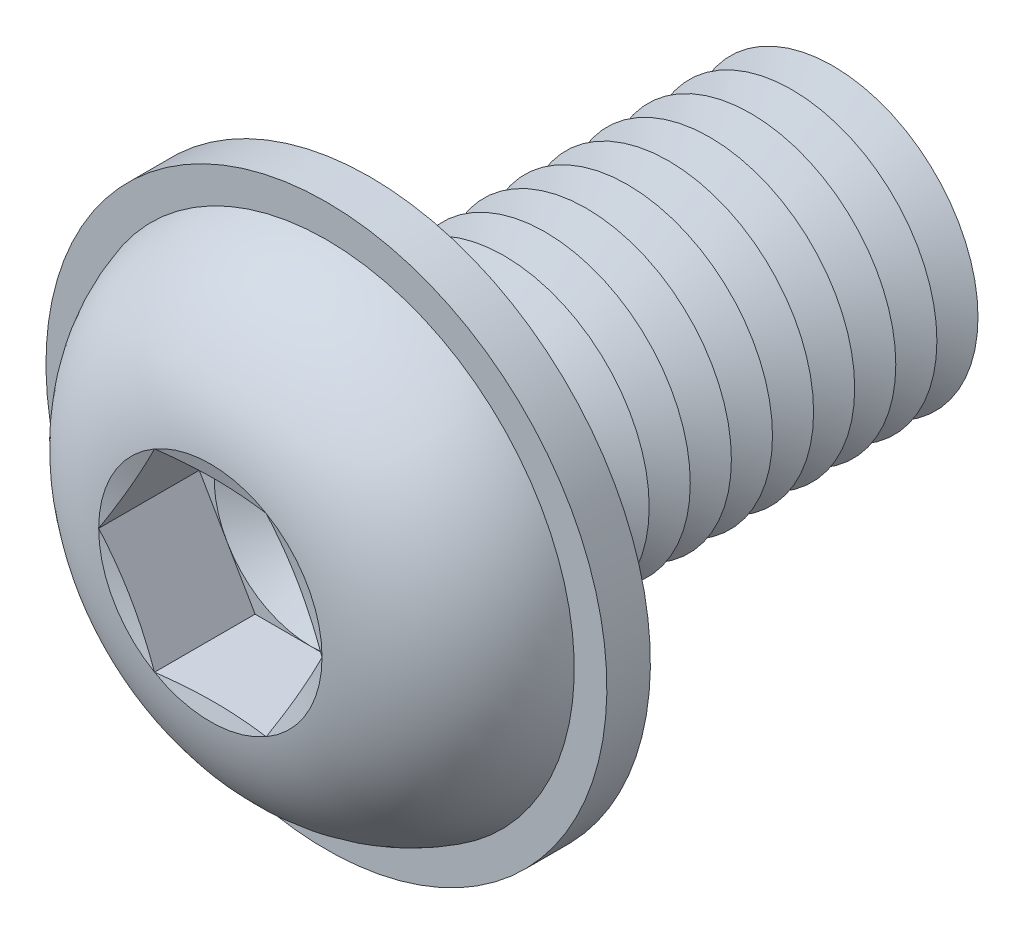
ISO-10303-21;
HEADER;
FILE_DESCRIPTION(('STEP AP214'),'2;1');
FILE_NAME('part.step','',(''),(''),'','','');
FILE_SCHEMA(('AUTOMOTIVE_DESIGN { 1 0 10303 214 1 1 1 1 }'));
ENDSEC;
DATA;
#1=APPLICATION_CONTEXT('core data for automotive mechanical design processes');
#2=APPLICATION_PROTOCOL_DEFINITION('international standard','automotive_design',2000,#1);
#3=PRODUCT_CONTEXT('',#1,'mechanical');
#4=PRODUCT('Part','Part','',(#3));
#5=PRODUCT_RELATED_PRODUCT_CATEGORY('part','',(#4));
#6=PRODUCT_DEFINITION_FORMATION('','',#4);
#7=PRODUCT_DEFINITION_CONTEXT('part definition',#1,'design');
#8=PRODUCT_DEFINITION('design','',#6,#7);
#9=PRODUCT_DEFINITION_SHAPE('','',#8);
#10=(LENGTH_UNIT() NAMED_UNIT(*) SI_UNIT(.MILLI.,.METRE.));
#11=(NAMED_UNIT(*) PLANE_ANGLE_UNIT() SI_UNIT($,.RADIAN.));
#12=(NAMED_UNIT(*) SI_UNIT($,.STERADIAN.) SOLID_ANGLE_UNIT());
#13=UNCERTAINTY_MEASURE_WITH_UNIT(LENGTH_MEASURE(1.E-05),#10,'distance_accuracy_value','');
#14=(GEOMETRIC_REPRESENTATION_CONTEXT(3) GLOBAL_UNCERTAINTY_ASSIGNED_CONTEXT((#13)) GLOBAL_UNIT_ASSIGNED_CONTEXT((#10,
#11,#12)) REPRESENTATION_CONTEXT('',''));
#15=CARTESIAN_POINT('',(0.,0.,0.));
#16=DIRECTION('',(0.,0.,1.));
#17=DIRECTION('',(1.,0.,0.));
#18=AXIS2_PLACEMENT_3D('',#15,#16,#17);
#19=CARTESIAN_POINT('',(0.,0.,-14.05));
#20=DIRECTION('',(0.,0.,1.));
#21=DIRECTION('',(0.,-1.,0.));
#22=AXIS2_PLACEMENT_3D('',#19,#20,#21);
#23=CONICAL_SURFACE('',#22,5.99999999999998,1.0471975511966);
#24=CARTESIAN_POINT('',(0.,0.,-14.9));
#25=DIRECTION('',(0.,0.,1.));
#26=DIRECTION('',(0.,-1.,0.));
#27=AXIS2_PLACEMENT_3D('',#24,#25,#26);
#28=CIRCLE('',#27,4.52775681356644);
#29=CARTESIAN_POINT('',(0.,-4.52775681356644,-14.9));
#30=VERTEX_POINT('',#29);
#31=EDGE_CURVE('E296',#30,#30,#28,.T.);
#32=ORIENTED_EDGE('',*,*,#31,.T.);
#33=EDGE_LOOP('',(#32));
#34=FACE_BOUND('',#33,.T.);
#35=CARTESIAN_POINT('',(0.,0.,-14.05));
#36=DIRECTION('',(0.,0.,1.));
#37=DIRECTION('',(0.,-1.,0.));
#38=AXIS2_PLACEMENT_3D('',#35,#36,#37);
#39=CIRCLE('',#38,5.99999999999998);
#40=CARTESIAN_POINT('',(0.,-5.99999999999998,-14.05));
#41=VERTEX_POINT('',#40);
#42=EDGE_CURVE('E292',#41,#41,#39,.T.);
#43=ORIENTED_EDGE('',*,*,#42,.F.);
#44=EDGE_LOOP('',(#43));
#45=FACE_BOUND('',#44,.T.);
#46=ADVANCED_FACE('F38',(#34,#45),#23,.T.);
#47=CARTESIAN_POINT('',(0.,0.,-14.9));
#48=DIRECTION('',(0.,0.,-1.));
#49=DIRECTION('',(0.,1.,0.));
#50=AXIS2_PLACEMENT_3D('',#47,#48,#49);
#51=CONICAL_SURFACE('',#50,4.52775681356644,1.04719755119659);
#52=CARTESIAN_POINT('',(0.,0.,-15.75));
#53=DIRECTION('',(0.,0.,1.));
#54=DIRECTION('',(0.,-1.,0.));
#55=AXIS2_PLACEMENT_3D('',#52,#53,#54);
#56=CIRCLE('',#55,5.99999999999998);
#57=CARTESIAN_POINT('',(0.,-5.99999999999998,-15.75));
#58=VERTEX_POINT('',#57);
#59=EDGE_CURVE('E300',#58,#58,#56,.T.);
#60=ORIENTED_EDGE('',*,*,#59,.T.);
#61=EDGE_LOOP('',(#60));
#62=FACE_BOUND('',#61,.T.);
#63=ORIENTED_EDGE('',*,*,#31,.F.);
#64=EDGE_LOOP('',(#63));
#65=FACE_BOUND('',#64,.T.);
#66=ADVANCED_FACE('F421',(#62,#65),#51,.T.);
#67=CARTESIAN_POINT('',(0.,5.99999999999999,-20.));
#68=DIRECTION('',(0.,0.,-1.));
#69=DIRECTION('',(0.,1.,0.));
#70=AXIS2_PLACEMENT_3D('',#67,#68,#69);
#71=PLANE('',#70);
#72=CARTESIAN_POINT('',(0.,0.,-20.));
#73=DIRECTION('',(0.,0.,1.));
#74=DIRECTION('',(0.,-1.,0.));
#75=AXIS2_PLACEMENT_3D('',#72,#73,#74);
#76=CIRCLE('',#75,4.52775681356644);
#77=CARTESIAN_POINT('',(0.,-4.52775681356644,-20.));
#78=VERTEX_POINT('',#77);
#79=EDGE_CURVE('E320',#78,#78,#76,.T.);
#80=ORIENTED_EDGE('',*,*,#79,.F.);
#81=EDGE_LOOP('',(#80));
#82=FACE_BOUND('',#81,.T.);
#83=ADVANCED_FACE('F427',(#82),#71,.T.);
#84=CARTESIAN_POINT('',(0.,0.,-19.15));
#85=DIRECTION('',(0.,0.,1.));
#86=DIRECTION('',(0.,-1.,0.));
#87=AXIS2_PLACEMENT_3D('',#84,#85,#86);
#88=CONICAL_SURFACE('',#87,5.99999999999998,1.0471975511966);
#89=ORIENTED_EDGE('',*,*,#79,.T.);
#90=EDGE_LOOP('',(#89));
#91=FACE_BOUND('',#90,.T.);
#92=CARTESIAN_POINT('',(0.,0.,-19.15));
#93=DIRECTION('',(0.,0.,1.));
#94=DIRECTION('',(0.,-1.,0.));
#95=AXIS2_PLACEMENT_3D('',#92,#93,#94);
#96=CIRCLE('',#95,5.99999999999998);
#97=CARTESIAN_POINT('',(0.,-5.99999999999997,-19.15));
#98=VERTEX_POINT('',#97);
#99=EDGE_CURVE('E316',#98,#98,#96,.T.);
#100=ORIENTED_EDGE('',*,*,#99,.F.);
#101=EDGE_LOOP('',(#100));
#102=FACE_BOUND('',#101,.T.);
#103=ADVANCED_FACE('F446',(#91,#102),#88,.T.);
#104=CARTESIAN_POINT('',(0.,0.,-18.3));
#105=DIRECTION('',(0.,0.,-1.));
#106=DIRECTION('',(0.,1.,0.));
#107=AXIS2_PLACEMENT_3D('',#104,#105,#106);
#108=CONICAL_SURFACE('',#107,4.52775681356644,1.04719755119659);
#109=ORIENTED_EDGE('',*,*,#99,.T.);
#110=EDGE_LOOP('',(#109));
#111=FACE_BOUND('',#110,.T.);
#112=CARTESIAN_POINT('',(0.,0.,-18.3));
#113=DIRECTION('',(0.,0.,1.));
#114=DIRECTION('',(0.,-1.,0.));
#115=AXIS2_PLACEMENT_3D('',#112,#113,#114);
#116=CIRCLE('',#115,4.52775681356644);
#117=CARTESIAN_POINT('',(0.,-4.52775681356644,-18.3));
#118=VERTEX_POINT('',#117);
#119=EDGE_CURVE('E312',#118,#118,#116,.T.);
#120=ORIENTED_EDGE('',*,*,#119,.F.);
#121=EDGE_LOOP('',(#120));
#122=FACE_BOUND('',#121,.T.);
#123=ADVANCED_FACE('F443',(#111,#122),#108,.T.);
#124=CARTESIAN_POINT('',(0.,0.,-17.45));
#125=DIRECTION('',(0.,0.,1.));
#126=DIRECTION('',(0.,-1.,0.));
#127=AXIS2_PLACEMENT_3D('',#124,#125,#126);
#128=CONICAL_SURFACE('',#127,5.99999999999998,1.0471975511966);
#129=ORIENTED_EDGE('',*,*,#119,.T.);
#130=EDGE_LOOP('',(#129));
#131=FACE_BOUND('',#130,.T.);
#132=CARTESIAN_POINT('',(0.,0.,-17.45));
#133=DIRECTION('',(0.,0.,1.));
#134=DIRECTION('',(0.,-1.,0.));
#135=AXIS2_PLACEMENT_3D('',#132,#133,#134);
#136=CIRCLE('',#135,5.99999999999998);
#137=CARTESIAN_POINT('',(0.,-5.99999999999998,-17.45));
#138=VERTEX_POINT('',#137);
#139=EDGE_CURVE('E308',#138,#138,#136,.T.);
#140=ORIENTED_EDGE('',*,*,#139,.F.);
#141=EDGE_LOOP('',(#140));
#142=FACE_BOUND('',#141,.T.);
#143=ADVANCED_FACE('F437',(#131,#142),#128,.T.);
#144=CARTESIAN_POINT('',(0.,0.,-16.6));
#145=DIRECTION('',(0.,0.,-1.));
#146=DIRECTION('',(0.,1.,0.));
#147=AXIS2_PLACEMENT_3D('',#144,#145,#146);
#148=CONICAL_SURFACE('',#147,4.52775681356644,1.04719755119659);
#149=ORIENTED_EDGE('',*,*,#139,.T.);
#150=EDGE_LOOP('',(#149));
#151=FACE_BOUND('',#150,.T.);
#152=CARTESIAN_POINT('',(0.,0.,-16.6));
#153=DIRECTION('',(0.,0.,1.));
#154=DIRECTION('',(0.,-1.,0.));
#155=AXIS2_PLACEMENT_3D('',#152,#153,#154);
#156=CIRCLE('',#155,4.52775681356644);
#157=CARTESIAN_POINT('',(0.,-4.52775681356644,-16.6));
#158=VERTEX_POINT('',#157);
#159=EDGE_CURVE('E304',#158,#158,#156,.T.);
#160=ORIENTED_EDGE('',*,*,#159,.F.);
#161=EDGE_LOOP('',(#160));
#162=FACE_BOUND('',#161,.T.);
#163=ADVANCED_FACE('F433',(#151,#162),#148,.T.);
#164=CARTESIAN_POINT('',(0.,0.,-15.75));
#165=DIRECTION('',(0.,0.,1.));
#166=DIRECTION('',(0.,-1.,0.));
#167=AXIS2_PLACEMENT_3D('',#164,#165,#166);
#168=CONICAL_SURFACE('',#167,5.99999999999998,1.0471975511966);
#169=ORIENTED_EDGE('',*,*,#159,.T.);
#170=EDGE_LOOP('',(#169));
#171=FACE_BOUND('',#170,.T.);
#172=ORIENTED_EDGE('',*,*,#59,.F.);
#173=EDGE_LOOP('',(#172));
#174=FACE_BOUND('',#173,.T.);
#175=ADVANCED_FACE('F436',(#171,#174),#168,.T.);
#176=CARTESIAN_POINT('',(0.,0.,-12.35));
#177=DIRECTION('',(0.,0.,1.));
#178=DIRECTION('',(0.,-1.,0.));
#179=AXIS2_PLACEMENT_3D('',#176,#177,#178);
#180=CONICAL_SURFACE('',#179,5.99999999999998,1.0471975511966);
#181=CARTESIAN_POINT('',(0.,0.,-13.2));
#182=DIRECTION('',(0.,0.,1.));
#183=DIRECTION('',(0.,-1.,0.));
#184=AXIS2_PLACEMENT_3D('',#181,#182,#183);
#185=CIRCLE('',#184,4.52775681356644);
#186=CARTESIAN_POINT('',(0.,-4.52775681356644,-13.2));
#187=VERTEX_POINT('',#186);
#188=EDGE_CURVE('E288',#187,#187,#185,.T.);
#189=ORIENTED_EDGE('',*,*,#188,.T.);
#190=EDGE_LOOP('',(#189));
#191=FACE_BOUND('',#190,.T.);
#192=CARTESIAN_POINT('',(0.,0.,-12.35));
#193=DIRECTION('',(0.,0.,1.));
#194=DIRECTION('',(0.,-1.,0.));
#195=AXIS2_PLACEMENT_3D('',#192,#193,#194);
#196=CIRCLE('',#195,5.99999999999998);
#197=CARTESIAN_POINT('',(0.,-5.99999999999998,-12.35));
#198=VERTEX_POINT('',#197);
#199=EDGE_CURVE('E284',#198,#198,#196,.T.);
#200=ORIENTED_EDGE('',*,*,#199,.F.);
#201=EDGE_LOOP('',(#200));
#202=FACE_BOUND('',#201,.T.);
#203=ADVANCED_FACE('F441',(#191,#202),#180,.T.);
#204=CARTESIAN_POINT('',(0.,0.,-13.2));
#205=DIRECTION('',(0.,0.,-1.));
#206=DIRECTION('',(0.,1.,0.));
#207=AXIS2_PLACEMENT_3D('',#204,#205,#206);
#208=CONICAL_SURFACE('',#207,4.52775681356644,1.04719755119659);
#209=ORIENTED_EDGE('',*,*,#42,.T.);
#210=EDGE_LOOP('',(#209));
#211=FACE_BOUND('',#210,.T.);
#212=ORIENTED_EDGE('',*,*,#188,.F.);
#213=EDGE_LOOP('',(#212));
#214=FACE_BOUND('',#213,.T.);
#215=ADVANCED_FACE('F492',(#211,#214),#208,.T.);
#216=CARTESIAN_POINT('',(0.,0.,-10.65));
#217=DIRECTION('',(0.,0.,1.));
#218=DIRECTION('',(0.,-1.,0.));
#219=AXIS2_PLACEMENT_3D('',#216,#217,#218);
#220=CONICAL_SURFACE('',#219,5.99999999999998,1.0471975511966);
#221=CARTESIAN_POINT('',(0.,0.,-11.5));
#222=DIRECTION('',(0.,0.,1.));
#223=DIRECTION('',(0.,-1.,0.));
#224=AXIS2_PLACEMENT_3D('',#221,#222,#223);
#225=CIRCLE('',#224,4.52775681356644);
#226=CARTESIAN_POINT('',(0.,-4.52775681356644,-11.5));
#227=VERTEX_POINT('',#226);
#228=EDGE_CURVE('E281',#227,#227,#225,.T.);
#229=ORIENTED_EDGE('',*,*,#228,.T.);
#230=EDGE_LOOP('',(#229));
#231=FACE_BOUND('',#230,.T.);
#232=CARTESIAN_POINT('',(0.,0.,-10.65));
#233=DIRECTION('',(0.,0.,1.));
#234=DIRECTION('',(0.,-1.,0.));
#235=AXIS2_PLACEMENT_3D('',#232,#233,#234);
#236=CIRCLE('',#235,5.99999999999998);
#237=CARTESIAN_POINT('',(0.,-5.99999999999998,-10.65));
#238=VERTEX_POINT('',#237);
#239=EDGE_CURVE('E277',#238,#238,#236,.T.);
#240=ORIENTED_EDGE('',*,*,#239,.F.);
#241=EDGE_LOOP('',(#240));
#242=FACE_BOUND('',#241,.T.);
#243=ADVANCED_FACE('F498',(#231,#242),#220,.T.);
#244=CARTESIAN_POINT('',(0.,0.,-11.5));
#245=DIRECTION('',(0.,0.,-1.));
#246=DIRECTION('',(0.,1.,0.));
#247=AXIS2_PLACEMENT_3D('',#244,#245,#246);
#248=CONICAL_SURFACE('',#247,4.52775681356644,1.04719755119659);
#249=ORIENTED_EDGE('',*,*,#199,.T.);
#250=EDGE_LOOP('',(#249));
#251=FACE_BOUND('',#250,.T.);
#252=ORIENTED_EDGE('',*,*,#228,.F.);
#253=EDGE_LOOP('',(#252));
#254=FACE_BOUND('',#253,.T.);
#255=ADVANCED_FACE('F505',(#251,#254),#248,.T.);
#256=CARTESIAN_POINT('',(0.,0.,-8.95000000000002));
#257=DIRECTION('',(0.,0.,1.));
#258=DIRECTION('',(0.,-1.,0.));
#259=AXIS2_PLACEMENT_3D('',#256,#257,#258);
#260=CONICAL_SURFACE('',#259,5.99999999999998,1.0471975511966);
#261=CARTESIAN_POINT('',(0.,0.,-9.8));
#262=DIRECTION('',(0.,0.,1.));
#263=DIRECTION('',(0.,-1.,0.));
#264=AXIS2_PLACEMENT_3D('',#261,#262,#263);
#265=CIRCLE('',#264,4.52775681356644);
#266=CARTESIAN_POINT('',(0.,-4.52775681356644,-9.80000000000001));
#267=VERTEX_POINT('',#266);
#268=EDGE_CURVE('E273',#267,#267,#265,.T.);
#269=ORIENTED_EDGE('',*,*,#268,.T.);
#270=EDGE_LOOP('',(#269));
#271=FACE_BOUND('',#270,.T.);
#272=CARTESIAN_POINT('',(0.,0.,-8.95000000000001));
#273=DIRECTION('',(0.,0.,1.));
#274=DIRECTION('',(0.,-1.,0.));
#275=AXIS2_PLACEMENT_3D('',#272,#273,#274);
#276=CIRCLE('',#275,5.99999999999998);
#277=CARTESIAN_POINT('',(0.,-5.99999999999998,-8.95000000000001));
#278=VERTEX_POINT('',#277);
#279=EDGE_CURVE('E269',#278,#278,#276,.T.);
#280=ORIENTED_EDGE('',*,*,#279,.F.);
#281=EDGE_LOOP('',(#280));
#282=FACE_BOUND('',#281,.T.);
#283=ADVANCED_FACE('F512',(#271,#282),#260,.T.);
#284=CARTESIAN_POINT('',(0.,0.,-9.8));
#285=DIRECTION('',(0.,0.,-1.));
#286=DIRECTION('',(0.,1.,0.));
#287=AXIS2_PLACEMENT_3D('',#284,#285,#286);
#288=CONICAL_SURFACE('',#287,4.52775681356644,1.04719755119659);
#289=ORIENTED_EDGE('',*,*,#239,.T.);
#290=EDGE_LOOP('',(#289));
#291=FACE_BOUND('',#290,.T.);
#292=ORIENTED_EDGE('',*,*,#268,.F.);
#293=EDGE_LOOP('',(#292));
#294=FACE_BOUND('',#293,.T.);
#295=ADVANCED_FACE('F519',(#291,#294),#288,.T.);
#296=CARTESIAN_POINT('',(0.,0.,-7.25000000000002));
#297=DIRECTION('',(0.,0.,1.));
#298=DIRECTION('',(0.,-1.,0.));
#299=AXIS2_PLACEMENT_3D('',#296,#297,#298);
#300=CONICAL_SURFACE('',#299,5.99999999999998,1.0471975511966);
#301=CARTESIAN_POINT('',(0.,0.,-8.1));
#302=DIRECTION('',(0.,0.,1.));
#303=DIRECTION('',(0.,-1.,0.));
#304=AXIS2_PLACEMENT_3D('',#301,#302,#303);
#305=CIRCLE('',#304,4.52775681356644);
#306=CARTESIAN_POINT('',(0.,-4.52775681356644,-8.10000000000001));
#307=VERTEX_POINT('',#306);
#308=EDGE_CURVE('E265',#307,#307,#305,.T.);
#309=ORIENTED_EDGE('',*,*,#308,.T.);
#310=EDGE_LOOP('',(#309));
#311=FACE_BOUND('',#310,.T.);
#312=CARTESIAN_POINT('',(0.,0.,-7.25000000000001));
#313=DIRECTION('',(0.,0.,1.));
#314=DIRECTION('',(0.,-1.,0.));
#315=AXIS2_PLACEMENT_3D('',#312,#313,#314);
#316=CIRCLE('',#315,5.99999999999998);
#317=CARTESIAN_POINT('',(0.,-5.99999999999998,-7.25000000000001));
#318=VERTEX_POINT('',#317);
#319=EDGE_CURVE('E261',#318,#318,#316,.T.);
#320=ORIENTED_EDGE('',*,*,#319,.F.);
#321=EDGE_LOOP('',(#320));
#322=FACE_BOUND('',#321,.T.);
#323=ADVANCED_FACE('F526',(#311,#322),#300,.T.);
#324=CARTESIAN_POINT('',(0.,0.,-8.1));
#325=DIRECTION('',(0.,0.,-1.));
#326=DIRECTION('',(0.,1.,0.));
#327=AXIS2_PLACEMENT_3D('',#324,#325,#326);
#328=CONICAL_SURFACE('',#327,4.52775681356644,1.04719755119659);
#329=ORIENTED_EDGE('',*,*,#279,.T.);
#330=EDGE_LOOP('',(#329));
#331=FACE_BOUND('',#330,.T.);
#332=ORIENTED_EDGE('',*,*,#308,.F.);
#333=EDGE_LOOP('',(#332));
#334=FACE_BOUND('',#333,.T.);
#335=ADVANCED_FACE('F533',(#331,#334),#328,.T.);
#336=CARTESIAN_POINT('',(0.,0.,-5.55000000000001));
#337=DIRECTION('',(0.,0.,1.));
#338=DIRECTION('',(0.,-1.,0.));
#339=AXIS2_PLACEMENT_3D('',#336,#337,#338);
#340=CONICAL_SURFACE('',#339,5.99999999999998,1.0471975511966);
#341=CARTESIAN_POINT('',(0.,0.,-6.4));
#342=DIRECTION('',(0.,0.,1.));
#343=DIRECTION('',(0.,-1.,0.));
#344=AXIS2_PLACEMENT_3D('',#341,#342,#343);
#345=CIRCLE('',#344,4.52775681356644);
#346=CARTESIAN_POINT('',(0.,-4.52775681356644,-6.40000000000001));
#347=VERTEX_POINT('',#346);
#348=EDGE_CURVE('E257',#347,#347,#345,.T.);
#349=ORIENTED_EDGE('',*,*,#348,.T.);
#350=EDGE_LOOP('',(#349));
#351=FACE_BOUND('',#350,.T.);
#352=CARTESIAN_POINT('',(0.,0.,-5.55000000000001));
#353=DIRECTION('',(0.,0.,1.));
#354=DIRECTION('',(0.,-1.,0.));
#355=AXIS2_PLACEMENT_3D('',#352,#353,#354);
#356=CIRCLE('',#355,5.99999999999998);
#357=CARTESIAN_POINT('',(0.,-5.99999999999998,-5.55000000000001));
#358=VERTEX_POINT('',#357);
#359=EDGE_CURVE('E253',#358,#358,#356,.T.);
#360=ORIENTED_EDGE('',*,*,#359,.F.);
#361=EDGE_LOOP('',(#360));
#362=FACE_BOUND('',#361,.T.);
#363=ADVANCED_FACE('F540',(#351,#362),#340,.T.);
#364=CARTESIAN_POINT('',(0.,0.,-6.4));
#365=DIRECTION('',(0.,0.,-1.));
#366=DIRECTION('',(0.,1.,0.));
#367=AXIS2_PLACEMENT_3D('',#364,#365,#366);
#368=CONICAL_SURFACE('',#367,4.52775681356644,1.04719755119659);
#369=ORIENTED_EDGE('',*,*,#319,.T.);
#370=EDGE_LOOP('',(#369));
#371=FACE_BOUND('',#370,.T.);
#372=ORIENTED_EDGE('',*,*,#348,.F.);
#373=EDGE_LOOP('',(#372));
#374=FACE_BOUND('',#373,.T.);
#375=ADVANCED_FACE('F547',(#371,#374),#368,.T.);
#376=CARTESIAN_POINT('',(0.,0.,-3.85000000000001));
#377=DIRECTION('',(0.,0.,1.));
#378=DIRECTION('',(0.,-1.,0.));
#379=AXIS2_PLACEMENT_3D('',#376,#377,#378);
#380=CONICAL_SURFACE('',#379,5.99999999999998,1.0471975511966);
#381=CARTESIAN_POINT('',(0.,0.,-4.7));
#382=DIRECTION('',(0.,0.,1.));
#383=DIRECTION('',(0.,-1.,0.));
#384=AXIS2_PLACEMENT_3D('',#381,#382,#383);
#385=CIRCLE('',#384,4.52775681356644);
#386=CARTESIAN_POINT('',(0.,-4.52775681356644,-4.70000000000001));
#387=VERTEX_POINT('',#386);
#388=EDGE_CURVE('E249',#387,#387,#385,.T.);
#389=ORIENTED_EDGE('',*,*,#388,.T.);
#390=EDGE_LOOP('',(#389));
#391=FACE_BOUND('',#390,.T.);
#392=CARTESIAN_POINT('',(0.,0.,-3.85000000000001));
#393=DIRECTION('',(0.,0.,1.));
#394=DIRECTION('',(0.,-1.,0.));
#395=AXIS2_PLACEMENT_3D('',#392,#393,#394);
#396=CIRCLE('',#395,5.99999999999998);
#397=CARTESIAN_POINT('',(0.,-5.99999999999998,-3.85000000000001));
#398=VERTEX_POINT('',#397);
#399=EDGE_CURVE('E241',#398,#398,#396,.T.);
#400=ORIENTED_EDGE('',*,*,#399,.F.);
#401=EDGE_LOOP('',(#400));
#402=FACE_BOUND('',#401,.T.);
#403=ADVANCED_FACE('F554',(#391,#402),#380,.T.);
#404=CARTESIAN_POINT('',(0.,0.,-4.7));
#405=DIRECTION('',(0.,0.,-1.));
#406=DIRECTION('',(0.,1.,0.));
#407=AXIS2_PLACEMENT_3D('',#404,#405,#406);
#408=CONICAL_SURFACE('',#407,4.52775681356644,1.04719755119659);
#409=ORIENTED_EDGE('',*,*,#359,.T.);
#410=EDGE_LOOP('',(#409));
#411=FACE_BOUND('',#410,.T.);
#412=ORIENTED_EDGE('',*,*,#388,.F.);
#413=EDGE_LOOP('',(#412));
#414=FACE_BOUND('',#413,.T.);
#415=ADVANCED_FACE('F561',(#411,#414),#408,.T.);
#416=CARTESIAN_POINT('',(0.,0.,-2.15000000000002));
#417=DIRECTION('',(0.,0.,1.));
#418=DIRECTION('',(0.,-1.,0.));
#419=AXIS2_PLACEMENT_3D('',#416,#417,#418);
#420=CONICAL_SURFACE('',#419,5.99999999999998,1.0471975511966);
#421=CARTESIAN_POINT('',(0.,0.,-3.00000000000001));
#422=DIRECTION('',(0.,0.,1.));
#423=DIRECTION('',(0.,-1.,0.));
#424=AXIS2_PLACEMENT_3D('',#421,#422,#423);
#425=CIRCLE('',#424,4.52775681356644);
#426=CARTESIAN_POINT('',(0.,-4.52775681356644,-3.00000000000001));
#427=VERTEX_POINT('',#426);
#428=EDGE_CURVE('E230',#427,#427,#425,.T.);
#429=ORIENTED_EDGE('',*,*,#428,.T.);
#430=EDGE_LOOP('',(#429));
#431=FACE_BOUND('',#430,.T.);
#432=CARTESIAN_POINT('',(0.,0.,-2.15000000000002));
#433=DIRECTION('',(0.,0.,1.));
#434=DIRECTION('',(0.,-1.,0.));
#435=AXIS2_PLACEMENT_3D('',#432,#433,#434);
#436=CIRCLE('',#435,5.99999999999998);
#437=CARTESIAN_POINT('',(0.,-5.99999999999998,-2.15000000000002));
#438=VERTEX_POINT('',#437);
#439=EDGE_CURVE('E245',#438,#438,#436,.T.);
#440=ORIENTED_EDGE('',*,*,#439,.F.);
#441=EDGE_LOOP('',(#440));
#442=FACE_BOUND('',#441,.T.);
#443=ADVANCED_FACE('F568',(#431,#442),#420,.T.);
#444=CARTESIAN_POINT('',(0.,0.,-3.00000000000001));
#445=DIRECTION('',(0.,0.,-1.));
#446=DIRECTION('',(0.,1.,0.));
#447=AXIS2_PLACEMENT_3D('',#444,#445,#446);
#448=CONICAL_SURFACE('',#447,4.52775681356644,1.04719755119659);
#449=ORIENTED_EDGE('',*,*,#399,.T.);
#450=EDGE_LOOP('',(#449));
#451=FACE_BOUND('',#450,.T.);
#452=ORIENTED_EDGE('',*,*,#428,.F.);
#453=EDGE_LOOP('',(#452));
#454=FACE_BOUND('',#453,.T.);
#455=ADVANCED_FACE('F219',(#451,#454),#448,.T.);
#456=CARTESIAN_POINT('',(0.,6.,0.));
#457=DIRECTION('',(0.,0.,-1.));
#458=DIRECTION('',(0.,1.,0.));
#459=AXIS2_PLACEMENT_3D('',#456,#457,#458);
#460=PLANE('',#459);
#461=CARTESIAN_POINT('',(0.,0.,0.));
#462=DIRECTION('',(0.,0.,-1.));
#463=DIRECTION('',(0.,1.,0.));
#464=AXIS2_PLACEMENT_3D('',#461,#462,#463);
#465=CIRCLE('',#464,6.84999999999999);
#466=CARTESIAN_POINT('',(0.,6.84999999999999,0.));
#467=VERTEX_POINT('',#466);
#468=EDGE_CURVE('E334',#467,#467,#465,.F.);
#469=ORIENTED_EDGE('',*,*,#468,.T.);
#470=EDGE_LOOP('',(#469));
#471=FACE_BOUND('',#470,.T.);
#472=CARTESIAN_POINT('',(0.,0.,0.));
#473=DIRECTION('',(0.,0.,-1.));
#474=DIRECTION('',(0.,1.,0.));
#475=AXIS2_PLACEMENT_3D('',#472,#473,#474);
#476=CIRCLE('',#475,11.6);
#477=CARTESIAN_POINT('',(0.,11.6,0.));
#478=VERTEX_POINT('',#477);
#479=EDGE_CURVE('E899',#478,#478,#476,.T.);
#480=ORIENTED_EDGE('',*,*,#479,.T.);
#481=EDGE_LOOP('',(#480));
#482=FACE_BOUND('',#481,.T.);
#483=ADVANCED_FACE('F580',(#471,#482),#460,.T.);
#484=CARTESIAN_POINT('',(0.,0.,-0.85));
#485=DIRECTION('',(0.,0.,-1.));
#486=DIRECTION('',(0.,1.,0.));
#487=AXIS2_PLACEMENT_3D('',#484,#485,#486);
#488=TOROIDAL_SURFACE('',#487,6.84999999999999,0.85);
#489=ORIENTED_EDGE('',*,*,#468,.F.);
#490=EDGE_LOOP('',(#489));
#491=FACE_BOUND('',#490,.T.);
#492=CARTESIAN_POINT('',(0.,0.,-0.85));
#493=DIRECTION('',(0.,0.,-1.));
#494=DIRECTION('',(0.,1.,0.));
#495=AXIS2_PLACEMENT_3D('',#492,#493,#494);
#496=CIRCLE('',#495,5.99999999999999);
#497=CARTESIAN_POINT('',(0.,5.99999999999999,-0.849999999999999));
#498=VERTEX_POINT('',#497);
#499=EDGE_CURVE('E329',#498,#498,#496,.T.);
#500=ORIENTED_EDGE('',*,*,#499,.F.);
#501=EDGE_LOOP('',(#500));
#502=FACE_BOUND('',#501,.T.);
#503=ADVANCED_FACE('F40',(#491,#502),#488,.F.);
#504=CARTESIAN_POINT('',(0.,0.,-20.));
#505=DIRECTION('',(0.,0.,-1.));
#506=DIRECTION('',(0.,1.,0.));
#507=AXIS2_PLACEMENT_3D('',#504,#505,#506);
#508=CYLINDRICAL_SURFACE('',#507,5.99999999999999);
#509=ORIENTED_EDGE('',*,*,#499,.T.);
#510=EDGE_LOOP('',(#509));
#511=FACE_BOUND('',#510,.T.);
#512=ORIENTED_EDGE('',*,*,#439,.T.);
#513=EDGE_LOOP('',(#512));
#514=FACE_BOUND('',#513,.T.);
#515=ADVANCED_FACE('F592',(#511,#514),#508,.T.);
#516=CARTESIAN_POINT('',(0.,0.,1.8));
#517=DIRECTION('',(0.,0.,-1.));
#518=DIRECTION('',(0.,1.,0.));
#519=AXIS2_PLACEMENT_3D('',#516,#517,#518);
#520=CYLINDRICAL_SURFACE('',#519,11.6);
#521=CARTESIAN_POINT('',(0.,0.,1.8));
#522=DIRECTION('',(0.,0.,-1.));
#523=DIRECTION('',(0.,1.,0.));
#524=AXIS2_PLACEMENT_3D('',#521,#522,#523);
#525=CIRCLE('',#524,11.6);
#526=CARTESIAN_POINT('',(0.,11.6,1.8));
#527=VERTEX_POINT('',#526);
#528=EDGE_CURVE('E895',#527,#527,#525,.T.);
#529=ORIENTED_EDGE('',*,*,#528,.T.);
#530=EDGE_LOOP('',(#529));
#531=FACE_BOUND('',#530,.T.);
#532=ORIENTED_EDGE('',*,*,#479,.F.);
#533=EDGE_LOOP('',(#532));
#534=FACE_BOUND('',#533,.T.);
#535=ADVANCED_FACE('F598',(#531,#534),#520,.T.);
#536=CARTESIAN_POINT('',(0.,0.,1.8));
#537=DIRECTION('',(0.,0.,-1.));
#538=DIRECTION('',(0.,1.,0.));
#539=AXIS2_PLACEMENT_3D('',#536,#537,#538);
#540=PLANE('',#539);
#541=CARTESIAN_POINT('',(0.,0.,1.8));
#542=DIRECTION('',(0.,0.,-1.));
#543=DIRECTION('',(0.,1.,0.));
#544=AXIS2_PLACEMENT_3D('',#541,#542,#543);
#545=CIRCLE('',#544,10.2515218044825);
#546=CARTESIAN_POINT('',(0.,10.2515218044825,1.8));
#547=VERTEX_POINT('',#546);
#548=EDGE_CURVE('E42',#547,#547,#545,.F.);
#549=ORIENTED_EDGE('',*,*,#548,.F.);
#550=EDGE_LOOP('',(#549));
#551=FACE_BOUND('',#550,.T.);
#552=ORIENTED_EDGE('',*,*,#528,.F.);
#553=EDGE_LOOP('',(#552));
#554=FACE_BOUND('',#553,.T.);
#555=ADVANCED_FACE('F116',(#551,#554),#540,.F.);
#556=CARTESIAN_POINT('',(0.,0.,2.43999999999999));
#557=DIRECTION('',(0.,0.,1.));
#558=DIRECTION('',(1.,0.,0.));
#559=AXIS2_PLACEMENT_3D('',#556,#557,#558);
#560=CONICAL_SURFACE('',#559,3.99999813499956,1.0471975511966);
#561=CARTESIAN_POINT('',(0.,0.,0.130600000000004));
#562=VERTEX_POINT('',#561);
#563=VERTEX_LOOP('',#562);
#564=FACE_BOUND('',#563,.T.);
#565=CARTESIAN_POINT('',(0.,0.,2.43999999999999));
#566=DIRECTION('',(0.,0.,1.));
#567=DIRECTION('',(1.,0.,0.));
#568=AXIS2_PLACEMENT_3D('',#565,#566,#567);
#569=CIRCLE('',#568,3.99999813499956);
#570=CARTESIAN_POINT('',(3.4641,1.99999906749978,2.43999999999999));
#571=VERTEX_POINT('',#570);
#572=CARTESIAN_POINT('',(0.,3.99999813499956,2.43999999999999));
#573=VERTEX_POINT('',#572);
#574=EDGE_CURVE('E119',#571,#573,#569,.T.);
#575=ORIENTED_EDGE('',*,*,#574,.T.);
#576=CARTESIAN_POINT('',(0.,0.,2.43999999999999));
#577=DIRECTION('',(0.,0.,1.));
#578=DIRECTION('',(1.,0.,0.));
#579=AXIS2_PLACEMENT_3D('',#576,#577,#578);
#580=CIRCLE('',#579,3.99999813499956);
#581=CARTESIAN_POINT('',(-3.4641,1.99999906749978,2.43999999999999));
#582=VERTEX_POINT('',#581);
#583=EDGE_CURVE('E11',#573,#582,#580,.T.);
#584=ORIENTED_EDGE('',*,*,#583,.T.);
#585=CARTESIAN_POINT('',(-3.4641,-1.99999906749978,2.43999999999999));
#586=VERTEX_POINT('',#585);
#587=EDGE_CURVE('E48',#582,#586,#580,.T.);
#588=ORIENTED_EDGE('',*,*,#587,.T.);
#589=CARTESIAN_POINT('',(0.,-3.99999813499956,2.43999999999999));
#590=VERTEX_POINT('',#589);
#591=EDGE_CURVE('E340',#586,#590,#580,.T.);
#592=ORIENTED_EDGE('',*,*,#591,.T.);
#593=CARTESIAN_POINT('',(3.4641,-1.99999906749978,2.43999999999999));
#594=VERTEX_POINT('',#593);
#595=EDGE_CURVE('E56',#590,#594,#580,.T.);
#596=ORIENTED_EDGE('',*,*,#595,.T.);
#597=EDGE_CURVE('E49',#594,#571,#580,.T.);
#598=ORIENTED_EDGE('',*,*,#597,.T.);
#599=EDGE_LOOP('',(#575,#584,#588,#592,#596,#598));
#600=FACE_BOUND('',#599,.T.);
#601=ADVANCED_FACE('F113',(#564,#600),#560,.F.);
#602=CARTESIAN_POINT('',(0.,0.,2.43999999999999));
#603=DIRECTION('',(0.,0.,1.));
#604=DIRECTION('',(1.,0.,0.));
#605=AXIS2_PLACEMENT_3D('',#602,#603,#604);
#606=PLANE('',#605);
#607=ORIENTED_EDGE('',*,*,#583,.F.);
#608=DIRECTION('',(-1.,0.,0.));
#609=VECTOR('',#608,1.);
#610=CARTESIAN_POINT('',(2.3094,3.99999813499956,2.43999999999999));
#611=LINE('',#610,#609);
#612=CARTESIAN_POINT('',(-2.3094,3.99999813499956,2.43999999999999));
#613=VERTEX_POINT('',#612);
#614=EDGE_CURVE('E131',#573,#613,#611,.T.);
#615=ORIENTED_EDGE('',*,*,#614,.T.);
#616=DIRECTION('',(-0.5,-0.866025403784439,0.));
#617=VECTOR('',#616,1.);
#618=CARTESIAN_POINT('',(-2.3094,3.99999813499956,2.43999999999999));
#619=LINE('',#618,#617);
#620=EDGE_CURVE('E134',#613,#582,#619,.T.);
#621=ORIENTED_EDGE('',*,*,#620,.T.);
#622=EDGE_LOOP('',(#607,#615,#621));
#623=FACE_BOUND('',#622,.T.);
#624=ADVANCED_FACE('F115',(#623),#606,.T.);
#625=ORIENTED_EDGE('',*,*,#587,.F.);
#626=CARTESIAN_POINT('',(-4.6188,0.,2.43999999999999));
#627=VERTEX_POINT('',#626);
#628=EDGE_CURVE('E144',#582,#627,#619,.T.);
#629=ORIENTED_EDGE('',*,*,#628,.T.);
#630=DIRECTION('',(0.5,-0.866025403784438,0.));
#631=VECTOR('',#630,1.);
#632=CARTESIAN_POINT('',(-4.6188,0.,2.43999999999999));
#633=LINE('',#632,#631);
#634=EDGE_CURVE('E153',#627,#586,#633,.T.);
#635=ORIENTED_EDGE('',*,*,#634,.T.);
#636=EDGE_LOOP('',(#625,#629,#635));
#637=FACE_BOUND('',#636,.T.);
#638=ADVANCED_FACE('F355',(#637),#606,.T.);
#639=ORIENTED_EDGE('',*,*,#591,.F.);
#640=CARTESIAN_POINT('',(-2.3094,-3.99999813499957,2.43999999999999));
#641=VERTEX_POINT('',#640);
#642=EDGE_CURVE('E152',#586,#641,#633,.T.);
#643=ORIENTED_EDGE('',*,*,#642,.T.);
#644=DIRECTION('',(1.,0.,0.));
#645=VECTOR('',#644,1.);
#646=CARTESIAN_POINT('',(-2.3094,-3.99999813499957,2.43999999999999));
#647=LINE('',#646,#645);
#648=EDGE_CURVE('E158',#641,#590,#647,.T.);
#649=ORIENTED_EDGE('',*,*,#648,.T.);
#650=EDGE_LOOP('',(#639,#643,#649));
#651=FACE_BOUND('',#650,.T.);
#652=ADVANCED_FACE('F348',(#651),#606,.T.);
#653=ORIENTED_EDGE('',*,*,#595,.F.);
#654=CARTESIAN_POINT('',(2.3094,-3.99999813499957,2.43999999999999));
#655=VERTEX_POINT('',#654);
#656=EDGE_CURVE('E157',#590,#655,#647,.T.);
#657=ORIENTED_EDGE('',*,*,#656,.T.);
#658=DIRECTION('',(0.5,0.866025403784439,0.));
#659=VECTOR('',#658,1.);
#660=CARTESIAN_POINT('',(2.3094,-3.99999813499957,2.43999999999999));
#661=LINE('',#660,#659);
#662=EDGE_CURVE('E163',#655,#594,#661,.T.);
#663=ORIENTED_EDGE('',*,*,#662,.T.);
#664=EDGE_LOOP('',(#653,#657,#663));
#665=FACE_BOUND('',#664,.T.);
#666=ADVANCED_FACE('F627',(#665),#606,.T.);
#667=ORIENTED_EDGE('',*,*,#597,.F.);
#668=CARTESIAN_POINT('',(4.6188,0.,2.43999999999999));
#669=VERTEX_POINT('',#668);
#670=EDGE_CURVE('E162',#594,#669,#661,.T.);
#671=ORIENTED_EDGE('',*,*,#670,.T.);
#672=DIRECTION('',(-0.5,0.866025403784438,0.));
#673=VECTOR('',#672,1.);
#674=CARTESIAN_POINT('',(4.6188,0.,2.43999999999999));
#675=LINE('',#674,#673);
#676=EDGE_CURVE('E140',#669,#571,#675,.T.);
#677=ORIENTED_EDGE('',*,*,#676,.T.);
#678=EDGE_LOOP('',(#667,#671,#677));
#679=FACE_BOUND('',#678,.T.);
#680=ADVANCED_FACE('F632',(#679),#606,.T.);
#681=ORIENTED_EDGE('',*,*,#574,.F.);
#682=CARTESIAN_POINT('',(2.3094,3.99999813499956,2.43999999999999));
#683=VERTEX_POINT('',#682);
#684=EDGE_CURVE('E126',#571,#683,#675,.T.);
#685=ORIENTED_EDGE('',*,*,#684,.T.);
#686=EDGE_CURVE('E136',#683,#573,#611,.T.);
#687=ORIENTED_EDGE('',*,*,#686,.T.);
#688=EDGE_LOOP('',(#681,#685,#687));
#689=FACE_BOUND('',#688,.T.);
#690=ADVANCED_FACE('F142',(#689),#606,.T.);
#691=CARTESIAN_POINT('',(2.3094,3.99999813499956,2.43999999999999));
#692=DIRECTION('',(0.,1.,0.));
#693=DIRECTION('',(0.,0.,1.));
#694=AXIS2_PLACEMENT_3D('',#691,#692,#693);
#695=PLANE('',#694);
#696=CARTESIAN_POINT('',(6.9696675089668,3.99999813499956,7.51561854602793));
#697=CARTESIAN_POINT('',(6.80094634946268,3.99999813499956,7.47641178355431));
#698=CARTESIAN_POINT('',(6.63214895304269,3.99999813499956,7.43753277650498));
#699=CARTESIAN_POINT('',(6.29436999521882,3.99999813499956,7.36057075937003));
#700=CARTESIAN_POINT('',(6.12538843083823,3.99999813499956,7.3224877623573));
#701=CARTESIAN_POINT('',(5.61806276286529,3.99999813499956,7.20963087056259));
#702=CARTESIAN_POINT('',(5.27940301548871,3.99999813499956,7.13626437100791));
#703=CARTESIAN_POINT('',(4.5977576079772,3.99999813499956,6.99431141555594));
#704=CARTESIAN_POINT('',(4.25476115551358,3.99999813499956,6.92577621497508));
#705=CARTESIAN_POINT('',(3.56716783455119,3.99999813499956,6.79696563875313));
#706=CARTESIAN_POINT('',(3.22257082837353,3.99999813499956,6.73669098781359));
#707=CARTESIAN_POINT('',(2.54069952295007,3.99999813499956,6.63002020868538));
#708=CARTESIAN_POINT('',(2.20347918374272,3.99999813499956,6.58329286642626));
#709=CARTESIAN_POINT('',(1.69624452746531,3.99999813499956,6.52585827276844));
#710=CARTESIAN_POINT('',(1.52694760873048,3.99999813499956,6.50882377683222));
#711=CARTESIAN_POINT('',(1.18793829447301,3.99999813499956,6.47963274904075));
#712=CARTESIAN_POINT('',(1.01822592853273,3.99999813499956,6.4674758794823));
#713=CARTESIAN_POINT('',(0.679233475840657,3.99999813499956,6.44863176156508));
#714=CARTESIAN_POINT('',(0.509954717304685,3.99999813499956,6.44192096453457));
#715=CARTESIAN_POINT('',(0.171265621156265,3.99999813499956,6.43422163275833));
#716=CARTESIAN_POINT('',(0.00185528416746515,3.99999813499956,6.43323307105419));
#717=CARTESIAN_POINT('',(-0.336912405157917,3.99999813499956,6.43703123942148));
#718=CARTESIAN_POINT('',(-0.506269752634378,3.99999813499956,6.44181839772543));
#719=CARTESIAN_POINT('',(-0.844732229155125,3.99999813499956,6.45691823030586));
#720=CARTESIAN_POINT('',(-1.01383735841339,3.99999813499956,6.46723089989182));
#721=CARTESIAN_POINT('',(-1.42449950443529,3.99999813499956,6.49843349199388));
#722=CARTESIAN_POINT('',(-1.66585565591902,3.99999813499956,6.52196685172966));
#723=CARTESIAN_POINT('',(-2.14755410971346,3.99999813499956,6.57749710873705));
#724=CARTESIAN_POINT('',(-2.38789644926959,3.99999813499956,6.60949369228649));
#725=CARTESIAN_POINT('',(-2.86835569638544,3.99999813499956,6.68017769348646));
#726=CARTESIAN_POINT('',(-3.10846949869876,3.99999813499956,6.71888590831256));
#727=CARTESIAN_POINT('',(-3.5878341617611,3.99999813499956,6.80132981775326));
#728=CARTESIAN_POINT('',(-3.82708497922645,3.99999813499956,6.84506576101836));
#729=CARTESIAN_POINT('',(-4.30977392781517,3.99999813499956,6.93726543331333));
#730=CARTESIAN_POINT('',(-4.55319689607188,3.99999813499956,6.98580793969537));
#731=CARTESIAN_POINT('',(-5.03943022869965,3.99999813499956,7.08586668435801));
#732=CARTESIAN_POINT('',(-5.28224058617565,3.99999813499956,7.13738295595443));
#733=CARTESIAN_POINT('',(-5.76604885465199,3.99999813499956,7.2423842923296));
#734=CARTESIAN_POINT('',(-6.00704943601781,3.99999813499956,7.29585711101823));
#735=CARTESIAN_POINT('',(-6.48863948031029,3.99999813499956,7.4045482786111));
#736=CARTESIAN_POINT('',(-6.72922897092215,3.99999813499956,7.45976650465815));
#737=CARTESIAN_POINT('',(-6.9696675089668,3.99999813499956,7.51561854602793));
#738=B_SPLINE_CURVE_WITH_KNOTS('',3,(#696,#697,#698,#699,#700,#701,#702,#703,#704,#705,#706,
#707,#708,#709,#710,#711,#712,#713,#714,#715,#716,#717,#718,#719,#720,#721,#722,#723,#724,#725,
#726,#727,#728,#729,#730,#731,#732,#733,#734,#735,#736,#737),.UNSPECIFIED.,.F.,.F.,(4,2,2,2,2,2,
2,2,2,2,2,2,2,2,2,2,2,2,2,2,4),(0.,0.519649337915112,1.03930720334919,2.07882421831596,
3.12808572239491,4.17743921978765,5.19841727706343,5.7088142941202,6.21917596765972,
6.7273189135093,7.23545946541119,7.74363769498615,8.25181549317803,8.9791183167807,
9.70639418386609,10.4359652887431,11.1655724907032,11.910195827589,12.6548275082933,
13.395405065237,14.1359306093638),.UNSPECIFIED.);
#739=CARTESIAN_POINT('',(2.30940000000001,3.99999813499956,6.6));
#740=VERTEX_POINT('',#739);
#741=CARTESIAN_POINT('',(-2.3094,3.99999813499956,6.59999999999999));
#742=VERTEX_POINT('',#741);
#743=EDGE_CURVE('E171',#740,#742,#738,.T.);
#744=ORIENTED_EDGE('',*,*,#743,.T.);
#745=DIRECTION('',(0.,0.,1.));
#746=VECTOR('',#745,1.);
#747=CARTESIAN_POINT('',(-2.3094,3.99999813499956,2.43999999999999));
#748=LINE('',#747,#746);
#749=EDGE_CURVE('E138',#613,#742,#748,.T.);
#750=ORIENTED_EDGE('',*,*,#749,.F.);
#751=ORIENTED_EDGE('',*,*,#614,.F.);
#752=ORIENTED_EDGE('',*,*,#686,.F.);
#753=DIRECTION('',(0.,0.,1.));
#754=VECTOR('',#753,1.);
#755=CARTESIAN_POINT('',(2.3094,3.99999813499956,2.43999999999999));
#756=LINE('',#755,#754);
#757=EDGE_CURVE('E64',#683,#740,#756,.T.);
#758=ORIENTED_EDGE('',*,*,#757,.T.);
#759=EDGE_LOOP('',(#744,#750,#751,#752,#758));
#760=FACE_BOUND('',#759,.T.);
#761=ADVANCED_FACE('F135',(#760),#695,.F.);
#762=CARTESIAN_POINT('',(-2.3094,3.99999813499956,2.43999999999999));
#763=DIRECTION('',(-0.866025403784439,0.5,0.));
#764=DIRECTION('',(-0.5,-0.866025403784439,0.));
#765=AXIS2_PLACEMENT_3D('',#762,#763,#764);
#766=PLANE('',#765);
#767=CARTESIAN_POINT('',(-2.30928452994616,4.00019813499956,6.6000309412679));
#768=CARTESIAN_POINT('',(-2.40519767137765,3.83407170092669,6.57431944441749));
#769=CARTESIAN_POINT('',(-2.50128472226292,3.66764404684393,6.55097758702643));
#770=CARTESIAN_POINT('',(-2.69379818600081,3.33420094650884,6.50996805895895));
#771=CARTESIAN_POINT('',(-2.79022472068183,3.16718528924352,6.49230269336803));
#772=CARTESIAN_POINT('',(-2.98283247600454,2.8335788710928,6.46367750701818));
#773=CARTESIAN_POINT('',(-3.07901239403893,2.66699036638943,6.45268354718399));
#774=CARTESIAN_POINT('',(-3.2714948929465,2.33360089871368,6.4379417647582));
#775=CARTESIAN_POINT('',(-3.36779744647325,2.16679998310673,6.43419253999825));
#776=CARTESIAN_POINT('',(-3.56040255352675,1.83319815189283,6.43419253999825));
#777=CARTESIAN_POINT('',(-3.6567051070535,1.66639723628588,6.4379417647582));
#778=CARTESIAN_POINT('',(-3.84918760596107,1.33300776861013,6.45268354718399));
#779=CARTESIAN_POINT('',(-3.94536752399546,1.16641926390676,6.46367750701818));
#780=CARTESIAN_POINT('',(-4.13797527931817,0.832812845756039,6.49230269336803));
#781=CARTESIAN_POINT('',(-4.23440181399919,0.665797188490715,6.50996805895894));
#782=CARTESIAN_POINT('',(-4.42691527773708,0.332354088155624,6.55097758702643));
#783=CARTESIAN_POINT('',(-4.52300232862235,0.165926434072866,6.57431944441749));
#784=CARTESIAN_POINT('',(-4.61891547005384,-0.000200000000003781,6.6000309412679));
#785=B_SPLINE_CURVE_WITH_KNOTS('',3,(#767,#768,#769,#770,#771,#772,#773,#774,#775,#776,#777,
#778,#779,#780,#781,#782,#783,#784),.UNSPECIFIED.,.F.,.F.,(4,2,2,2,2,2,2,2,4),(0.,
0.580655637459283,1.16154676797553,1.73943971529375,2.31722080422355,2.89500189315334,
3.47289484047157,4.05378597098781,4.63444160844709),.UNSPECIFIED.);
#786=CARTESIAN_POINT('',(-4.6188,0.,6.59999999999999));
#787=VERTEX_POINT('',#786);
#788=EDGE_CURVE('E196',#742,#787,#785,.T.);
#789=ORIENTED_EDGE('',*,*,#788,.T.);
#790=DIRECTION('',(0.,0.,1.));
#791=VECTOR('',#790,1.);
#792=CARTESIAN_POINT('',(-4.6188,0.,2.43999999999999));
#793=LINE('',#792,#791);
#794=EDGE_CURVE('E180',#627,#787,#793,.T.);
#795=ORIENTED_EDGE('',*,*,#794,.F.);
#796=ORIENTED_EDGE('',*,*,#628,.F.);
#797=ORIENTED_EDGE('',*,*,#620,.F.);
#798=ORIENTED_EDGE('',*,*,#749,.T.);
#799=EDGE_LOOP('',(#789,#795,#796,#797,#798));
#800=FACE_BOUND('',#799,.T.);
#801=ADVANCED_FACE('F210',(#800),#766,.F.);
#802=CARTESIAN_POINT('',(-4.6188,0.,2.43999999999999));
#803=DIRECTION('',(-0.866025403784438,-0.5,0.));
#804=DIRECTION('',(0.5,-0.866025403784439,0.));
#805=AXIS2_PLACEMENT_3D('',#802,#803,#804);
#806=PLANE('',#805);
#807=CARTESIAN_POINT('',(-4.61891547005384,0.000199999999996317,6.6000309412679));
#808=CARTESIAN_POINT('',(-4.52300232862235,-0.165926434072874,6.57431944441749));
#809=CARTESIAN_POINT('',(-4.42691527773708,-0.332354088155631,6.55097758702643));
#810=CARTESIAN_POINT('',(-4.23440181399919,-0.665797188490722,6.50996805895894));
#811=CARTESIAN_POINT('',(-4.13797527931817,-0.832812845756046,6.49230269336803));
#812=CARTESIAN_POINT('',(-3.94536752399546,-1.16641926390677,6.46367750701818));
#813=CARTESIAN_POINT('',(-3.84918760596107,-1.33300776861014,6.45268354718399));
#814=CARTESIAN_POINT('',(-3.6567051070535,-1.66639723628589,6.4379417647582));
#815=CARTESIAN_POINT('',(-3.56040255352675,-1.83319815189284,6.43419253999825));
#816=CARTESIAN_POINT('',(-3.36779744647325,-2.16679998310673,6.43419253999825));
#817=CARTESIAN_POINT('',(-3.2714948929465,-2.33360089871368,6.4379417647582));
#818=CARTESIAN_POINT('',(-3.07901239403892,-2.66699036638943,6.45268354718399));
#819=CARTESIAN_POINT('',(-2.98283247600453,-2.8335788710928,6.46367750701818));
#820=CARTESIAN_POINT('',(-2.79022472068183,-3.16718528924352,6.49230269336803));
#821=CARTESIAN_POINT('',(-2.69379818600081,-3.33420094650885,6.50996805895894));
#822=CARTESIAN_POINT('',(-2.50128472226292,-3.66764404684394,6.55097758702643));
#823=CARTESIAN_POINT('',(-2.40519767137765,-3.8340717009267,6.57431944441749));
#824=CARTESIAN_POINT('',(-2.30928452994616,-4.00019813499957,6.6000309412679));
#825=B_SPLINE_CURVE_WITH_KNOTS('',3,(#807,#808,#809,#810,#811,#812,#813,#814,#815,#816,#817,
#818,#819,#820,#821,#822,#823,#824),.UNSPECIFIED.,.F.,.F.,(4,2,2,2,2,2,2,2,4),(0.,
0.580655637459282,1.16154676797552,1.73943971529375,2.31722080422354,2.89500189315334,
3.47289484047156,4.05378597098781,4.63444160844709),.UNSPECIFIED.);
#826=CARTESIAN_POINT('',(-2.3094,-3.99999813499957,6.59999999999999));
#827=VERTEX_POINT('',#826);
#828=EDGE_CURVE('E360',#787,#827,#825,.T.);
#829=ORIENTED_EDGE('',*,*,#828,.T.);
#830=DIRECTION('',(0.,0.,1.));
#831=VECTOR('',#830,1.);
#832=CARTESIAN_POINT('',(-2.3094,-3.99999813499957,2.43999999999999));
#833=LINE('',#832,#831);
#834=EDGE_CURVE('E176',#641,#827,#833,.T.);
#835=ORIENTED_EDGE('',*,*,#834,.F.);
#836=ORIENTED_EDGE('',*,*,#642,.F.);
#837=ORIENTED_EDGE('',*,*,#634,.F.);
#838=ORIENTED_EDGE('',*,*,#794,.T.);
#839=EDGE_LOOP('',(#829,#835,#836,#837,#838));
#840=FACE_BOUND('',#839,.T.);
#841=ADVANCED_FACE('F353',(#840),#806,.F.);
#842=CARTESIAN_POINT('',(-2.3094,-3.99999813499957,2.43999999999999));
#843=DIRECTION('',(0.,-1.,0.));
#844=DIRECTION('',(1.,0.,0.));
#845=AXIS2_PLACEMENT_3D('',#842,#843,#844);
#846=PLANE('',#845);
#847=CARTESIAN_POINT('',(-6.96966750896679,-3.99999813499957,7.51561854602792));
#848=CARTESIAN_POINT('',(-6.80094634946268,-3.99999813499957,7.47641178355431));
#849=CARTESIAN_POINT('',(-6.63214895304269,-3.99999813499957,7.43753277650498));
#850=CARTESIAN_POINT('',(-6.29436999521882,-3.99999813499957,7.36057075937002));
#851=CARTESIAN_POINT('',(-6.12538843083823,-3.99999813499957,7.3224877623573));
#852=CARTESIAN_POINT('',(-5.61806276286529,-3.99999813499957,7.20963087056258));
#853=CARTESIAN_POINT('',(-5.27940301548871,-3.99999813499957,7.13626437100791));
#854=CARTESIAN_POINT('',(-4.5977576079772,-3.99999813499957,6.99431141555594));
#855=CARTESIAN_POINT('',(-4.25476115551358,-3.99999813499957,6.92577621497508));
#856=CARTESIAN_POINT('',(-3.56716783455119,-3.99999813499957,6.79696563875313));
#857=CARTESIAN_POINT('',(-3.22257082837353,-3.99999813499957,6.73669098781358));
#858=CARTESIAN_POINT('',(-2.54069952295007,-3.99999813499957,6.63002020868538));
#859=CARTESIAN_POINT('',(-2.20347918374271,-3.99999813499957,6.58329286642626));
#860=CARTESIAN_POINT('',(-1.6962445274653,-3.99999813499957,6.52585827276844));
#861=CARTESIAN_POINT('',(-1.52694760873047,-3.99999813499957,6.50882377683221));
#862=CARTESIAN_POINT('',(-1.187938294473,-3.99999813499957,6.47963274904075));
#863=CARTESIAN_POINT('',(-1.01822592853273,-3.99999813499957,6.4674758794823));
#864=CARTESIAN_POINT('',(-0.679233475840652,-3.99999813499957,6.44863176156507));
#865=CARTESIAN_POINT('',(-0.509954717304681,-3.99999813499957,6.44192096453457));
#866=CARTESIAN_POINT('',(-0.171265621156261,-3.99999813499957,6.43422163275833));
#867=CARTESIAN_POINT('',(-0.00185528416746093,-3.99999813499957,6.43323307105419));
#868=CARTESIAN_POINT('',(0.336912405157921,-3.99999813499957,6.43703123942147));
#869=CARTESIAN_POINT('',(0.506269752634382,-3.99999813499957,6.44181839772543));
#870=CARTESIAN_POINT('',(0.844732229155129,-3.99999813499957,6.45691823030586));
#871=CARTESIAN_POINT('',(1.0138373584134,-3.99999813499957,6.46723089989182));
#872=CARTESIAN_POINT('',(1.42449950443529,-3.99999813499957,6.49843349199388));
#873=CARTESIAN_POINT('',(1.66585565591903,-3.99999813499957,6.52196685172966));
#874=CARTESIAN_POINT('',(2.14755410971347,-3.99999813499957,6.57749710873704));
#875=CARTESIAN_POINT('',(2.3878964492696,-3.99999813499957,6.60949369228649));
#876=CARTESIAN_POINT('',(2.86835569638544,-3.99999813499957,6.68017769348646));
#877=CARTESIAN_POINT('',(3.10846949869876,-3.99999813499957,6.71888590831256));
#878=CARTESIAN_POINT('',(3.5878341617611,-3.99999813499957,6.80132981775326));
#879=CARTESIAN_POINT('',(3.82708497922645,-3.99999813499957,6.84506576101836));
#880=CARTESIAN_POINT('',(4.30977392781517,-3.99999813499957,6.93726543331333));
#881=CARTESIAN_POINT('',(4.55319689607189,-3.99999813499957,6.98580793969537));
#882=CARTESIAN_POINT('',(5.03943022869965,-3.99999813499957,7.08586668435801));
#883=CARTESIAN_POINT('',(5.28224058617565,-3.99999813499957,7.13738295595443));
#884=CARTESIAN_POINT('',(5.76604885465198,-3.99999813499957,7.24238429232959));
#885=CARTESIAN_POINT('',(6.00704943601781,-3.99999813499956,7.29585711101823));
#886=CARTESIAN_POINT('',(6.48863948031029,-3.99999813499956,7.4045482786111));
#887=CARTESIAN_POINT('',(6.72922897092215,-3.99999813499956,7.45976650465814));
#888=CARTESIAN_POINT('',(6.9696675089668,-3.99999813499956,7.51561854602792));
#889=B_SPLINE_CURVE_WITH_KNOTS('',3,(#847,#848,#849,#850,#851,#852,#853,#854,#855,#856,#857,
#858,#859,#860,#861,#862,#863,#864,#865,#866,#867,#868,#869,#870,#871,#872,#873,#874,#875,#876,
#877,#878,#879,#880,#881,#882,#883,#884,#885,#886,#887,#888),.UNSPECIFIED.,.F.,.F.,(4,2,2,2,2,2,
2,2,2,2,2,2,2,2,2,2,2,2,2,2,4),(0.,0.519649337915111,1.03930720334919,2.07882421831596,
3.12808572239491,4.17743921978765,5.19841727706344,5.7088142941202,6.21917596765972,
6.7273189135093,7.23545946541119,7.74363769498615,8.25181549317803,8.9791183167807,
9.70639418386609,10.4359652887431,11.1655724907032,11.910195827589,12.6548275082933,
13.395405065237,14.1359306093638),.UNSPECIFIED.);
#890=CARTESIAN_POINT('',(2.3094,-3.99999813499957,6.59999999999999));
#891=VERTEX_POINT('',#890);
#892=EDGE_CURVE('E369',#827,#891,#889,.T.);
#893=ORIENTED_EDGE('',*,*,#892,.T.);
#894=DIRECTION('',(0.,0.,1.));
#895=VECTOR('',#894,1.);
#896=CARTESIAN_POINT('',(2.3094,-3.99999813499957,2.43999999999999));
#897=LINE('',#896,#895);
#898=EDGE_CURVE('E172',#655,#891,#897,.T.);
#899=ORIENTED_EDGE('',*,*,#898,.F.);
#900=ORIENTED_EDGE('',*,*,#656,.F.);
#901=ORIENTED_EDGE('',*,*,#648,.F.);
#902=ORIENTED_EDGE('',*,*,#834,.T.);
#903=EDGE_LOOP('',(#893,#899,#900,#901,#902));
#904=FACE_BOUND('',#903,.T.);
#905=ADVANCED_FACE('F410',(#904),#846,.F.);
#906=CARTESIAN_POINT('',(2.3094,-3.99999813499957,2.43999999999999));
#907=DIRECTION('',(0.866025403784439,-0.5,0.));
#908=DIRECTION('',(0.5,0.866025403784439,0.));
#909=AXIS2_PLACEMENT_3D('',#906,#907,#908);
#910=PLANE('',#909);
#911=CARTESIAN_POINT('',(2.30928452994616,-4.00019813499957,6.6000309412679));
#912=CARTESIAN_POINT('',(2.40519767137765,-3.8340717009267,6.57431944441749));
#913=CARTESIAN_POINT('',(2.50128472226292,-3.66764404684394,6.55097758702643));
#914=CARTESIAN_POINT('',(2.69379818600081,-3.33420094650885,6.50996805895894));
#915=CARTESIAN_POINT('',(2.79022472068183,-3.16718528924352,6.49230269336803));
#916=CARTESIAN_POINT('',(2.98283247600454,-2.8335788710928,6.46367750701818));
#917=CARTESIAN_POINT('',(3.07901239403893,-2.66699036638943,6.45268354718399));
#918=CARTESIAN_POINT('',(3.2714948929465,-2.33360089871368,6.4379417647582));
#919=CARTESIAN_POINT('',(3.36779744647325,-2.16679998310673,6.43419253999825));
#920=CARTESIAN_POINT('',(3.56040255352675,-1.83319815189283,6.43419253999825));
#921=CARTESIAN_POINT('',(3.6567051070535,-1.66639723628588,6.4379417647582));
#922=CARTESIAN_POINT('',(3.84918760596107,-1.33300776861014,6.45268354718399));
#923=CARTESIAN_POINT('',(3.94536752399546,-1.16641926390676,6.46367750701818));
#924=CARTESIAN_POINT('',(4.13797527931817,-0.832812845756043,6.49230269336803));
#925=CARTESIAN_POINT('',(4.23440181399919,-0.665797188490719,6.50996805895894));
#926=CARTESIAN_POINT('',(4.42691527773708,-0.332354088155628,6.55097758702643));
#927=CARTESIAN_POINT('',(4.52300232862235,-0.165926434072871,6.57431944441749));
#928=CARTESIAN_POINT('',(4.61891547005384,0.000200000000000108,6.6000309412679));
#929=B_SPLINE_CURVE_WITH_KNOTS('',3,(#911,#912,#913,#914,#915,#916,#917,#918,#919,#920,#921,
#922,#923,#924,#925,#926,#927,#928),.UNSPECIFIED.,.F.,.F.,(4,2,2,2,2,2,2,2,4),(0.,
0.580655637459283,1.16154676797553,1.73943971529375,2.31722080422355,2.89500189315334,
3.47289484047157,4.05378597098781,4.63444160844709),.UNSPECIFIED.);
#930=CARTESIAN_POINT('',(4.6188,0.,6.59999999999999));
#931=VERTEX_POINT('',#930);
#932=EDGE_CURVE('E231',#891,#931,#929,.T.);
#933=ORIENTED_EDGE('',*,*,#932,.T.);
#934=DIRECTION('',(0.,0.,1.));
#935=VECTOR('',#934,1.);
#936=CARTESIAN_POINT('',(4.6188,0.,2.43999999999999));
#937=LINE('',#936,#935);
#938=EDGE_CURVE('E167',#669,#931,#937,.T.);
#939=ORIENTED_EDGE('',*,*,#938,.F.);
#940=ORIENTED_EDGE('',*,*,#670,.F.);
#941=ORIENTED_EDGE('',*,*,#662,.F.);
#942=ORIENTED_EDGE('',*,*,#898,.T.);
#943=EDGE_LOOP('',(#933,#939,#940,#941,#942));
#944=FACE_BOUND('',#943,.T.);
#945=ADVANCED_FACE('F217',(#944),#910,.F.);
#946=CARTESIAN_POINT('',(4.6188,0.,2.43999999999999));
#947=DIRECTION('',(0.866025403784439,0.5,0.));
#948=DIRECTION('',(-0.5,0.866025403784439,0.));
#949=AXIS2_PLACEMENT_3D('',#946,#947,#948);
#950=PLANE('',#949);
#951=CARTESIAN_POINT('',(4.61891547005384,-0.000200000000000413,6.6000309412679));
#952=CARTESIAN_POINT('',(4.52300232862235,0.16592643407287,6.57431944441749));
#953=CARTESIAN_POINT('',(4.42691527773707,0.332354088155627,6.55097758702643));
#954=CARTESIAN_POINT('',(4.23440181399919,0.665797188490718,6.50996805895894));
#955=CARTESIAN_POINT('',(4.13797527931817,0.832812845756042,6.49230269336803));
#956=CARTESIAN_POINT('',(3.94536752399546,1.16641926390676,6.46367750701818));
#957=CARTESIAN_POINT('',(3.84918760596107,1.33300776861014,6.45268354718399));
#958=CARTESIAN_POINT('',(3.6567051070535,1.66639723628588,6.4379417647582));
#959=CARTESIAN_POINT('',(3.56040255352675,1.83319815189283,6.43419253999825));
#960=CARTESIAN_POINT('',(3.36779744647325,2.16679998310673,6.43419253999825));
#961=CARTESIAN_POINT('',(3.2714948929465,2.33360089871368,6.4379417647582));
#962=CARTESIAN_POINT('',(3.07901239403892,2.66699036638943,6.45268354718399));
#963=CARTESIAN_POINT('',(2.98283247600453,2.8335788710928,6.46367750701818));
#964=CARTESIAN_POINT('',(2.79022472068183,3.16718528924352,6.49230269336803));
#965=CARTESIAN_POINT('',(2.69379818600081,3.33420094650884,6.50996805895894));
#966=CARTESIAN_POINT('',(2.50128472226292,3.66764404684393,6.55097758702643));
#967=CARTESIAN_POINT('',(2.40519767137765,3.83407170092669,6.57431944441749));
#968=CARTESIAN_POINT('',(2.30928452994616,4.00019813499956,6.6000309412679));
#969=B_SPLINE_CURVE_WITH_KNOTS('',3,(#951,#952,#953,#954,#955,#956,#957,#958,#959,#960,#961,
#962,#963,#964,#965,#966,#967,#968),.UNSPECIFIED.,.F.,.F.,(4,2,2,2,2,2,2,2,4),(0.,
0.580655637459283,1.16154676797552,1.73943971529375,2.31722080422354,2.89500189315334,
3.47289484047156,4.05378597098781,4.63444160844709),.UNSPECIFIED.);
#970=EDGE_CURVE('E222',#931,#740,#969,.T.);
#971=ORIENTED_EDGE('',*,*,#970,.T.);
#972=ORIENTED_EDGE('',*,*,#757,.F.);
#973=ORIENTED_EDGE('',*,*,#684,.F.);
#974=ORIENTED_EDGE('',*,*,#676,.F.);
#975=ORIENTED_EDGE('',*,*,#938,.T.);
#976=EDGE_LOOP('',(#971,#972,#973,#974,#975));
#977=FACE_BOUND('',#976,.T.);
#978=ADVANCED_FACE('F213',(#977),#950,.F.);
#979=CARTESIAN_POINT('',(0.,0.,6.59999999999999));
#980=DIRECTION('',(0.,0.,1.));
#981=DIRECTION('',(0.,-1.,0.));
#982=AXIS2_PLACEMENT_3D('',#979,#980,#981);
#983=CONICAL_SURFACE('',#982,4.6188,1.30899693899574);
#984=ORIENTED_EDGE('',*,*,#743,.F.);
#985=CARTESIAN_POINT('',(0.,0.,6.59999999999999));
#986=DIRECTION('',(0.,0.,-1.));
#987=DIRECTION('',(0.,1.,0.));
#988=AXIS2_PLACEMENT_3D('',#985,#986,#987);
#989=CIRCLE('',#988,4.6188);
#990=EDGE_CURVE('E324',#742,#740,#989,.T.);
#991=ORIENTED_EDGE('',*,*,#990,.F.);
#992=EDGE_LOOP('',(#984,#991));
#993=FACE_BOUND('',#992,.T.);
#994=ADVANCED_FACE('F203',(#993),#983,.F.);
#995=ORIENTED_EDGE('',*,*,#788,.F.);
#996=EDGE_CURVE('E372',#787,#742,#989,.T.);
#997=ORIENTED_EDGE('',*,*,#996,.F.);
#998=EDGE_LOOP('',(#995,#997));
#999=FACE_BOUND('',#998,.T.);
#1000=ADVANCED_FACE('F373',(#999),#983,.F.);
#1001=ORIENTED_EDGE('',*,*,#828,.F.);
#1002=EDGE_CURVE('E366',#827,#787,#989,.T.);
#1003=ORIENTED_EDGE('',*,*,#1002,.F.);
#1004=EDGE_LOOP('',(#1001,#1003));
#1005=FACE_BOUND('',#1004,.T.);
#1006=ADVANCED_FACE('F364',(#1005),#983,.F.);
#1007=ORIENTED_EDGE('',*,*,#892,.F.);
#1008=EDGE_CURVE('E382',#891,#827,#989,.T.);
#1009=ORIENTED_EDGE('',*,*,#1008,.F.);
#1010=EDGE_LOOP('',(#1007,#1009));
#1011=FACE_BOUND('',#1010,.T.);
#1012=ADVANCED_FACE('F398',(#1011),#983,.F.);
#1013=ORIENTED_EDGE('',*,*,#932,.F.);
#1014=EDGE_CURVE('E330',#931,#891,#989,.T.);
#1015=ORIENTED_EDGE('',*,*,#1014,.F.);
#1016=EDGE_LOOP('',(#1013,#1015));
#1017=FACE_BOUND('',#1016,.T.);
#1018=ADVANCED_FACE('F392',(#1017),#983,.F.);
#1019=ORIENTED_EDGE('',*,*,#970,.F.);
#1020=EDGE_CURVE('E325',#740,#931,#989,.T.);
#1021=ORIENTED_EDGE('',*,*,#1020,.F.);
#1022=EDGE_LOOP('',(#1019,#1021));
#1023=FACE_BOUND('',#1022,.T.);
#1024=ADVANCED_FACE('F675',(#1023),#983,.F.);
#1025=CARTESIAN_POINT('',(0.,0.,0.));
#1026=DIRECTION('',(0.,0.,-1.));
#1027=DIRECTION('',(0.,1.,0.));
#1028=AXIS2_PLACEMENT_3D('',#1025,#1026,#1027);
#1029=DEGENERATE_TOROIDAL_SURFACE('',#1028,3.85607414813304,6.64392585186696,.T.);
#1030=ORIENTED_EDGE('',*,*,#1020,.T.);
#1031=ORIENTED_EDGE('',*,*,#1014,.T.);
#1032=ORIENTED_EDGE('',*,*,#1008,.T.);
#1033=ORIENTED_EDGE('',*,*,#1002,.T.);
#1034=ORIENTED_EDGE('',*,*,#996,.T.);
#1035=ORIENTED_EDGE('',*,*,#990,.T.);
#1036=EDGE_LOOP('',(#1030,#1031,#1032,#1033,#1034,#1035));
#1037=FACE_BOUND('',#1036,.T.);
#1038=ORIENTED_EDGE('',*,*,#548,.T.);
#1039=EDGE_LOOP('',(#1038));
#1040=FACE_BOUND('',#1039,.T.);
#1041=ADVANCED_FACE('F378',(#1037,#1040),#1029,.T.);
#1042=CLOSED_SHELL('',(#46,#66,#83,#103,#123,#143,#163,#175,#203,#215,#243,#255,#283,#295,#323,
#335,#363,#375,#403,#415,#443,#455,#483,#503,#515,#535,#555,#601,#624,#638,#652,#666,#680,#690,
#761,#801,#841,#905,#945,#978,#994,#1000,#1006,#1012,#1018,#1024,#1041));
#1043=MANIFOLD_SOLID_BREP('B2',#1042);
#1044=ADVANCED_BREP_SHAPE_REPRESENTATION('',(#18,#1043),#14);
#1045=SHAPE_DEFINITION_REPRESENTATION(#9,#1044);
ENDSEC;
END-ISO-10303-21;
